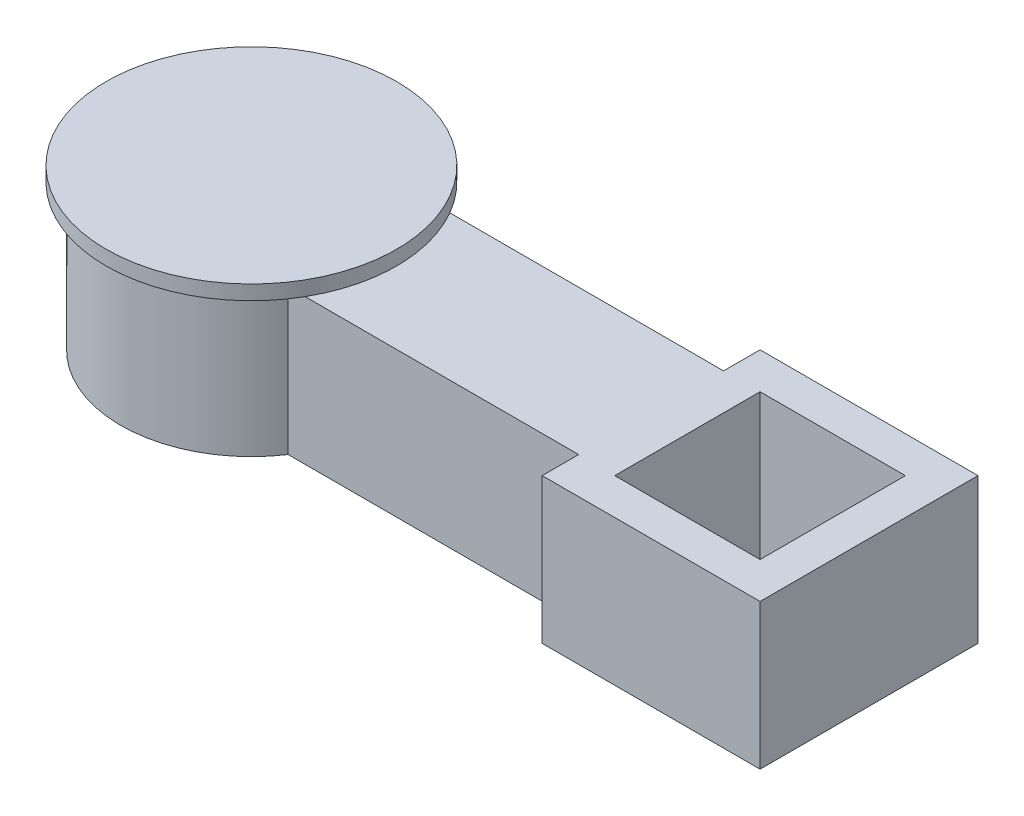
ISO-10303-21;
HEADER;
FILE_DESCRIPTION(('STEP AP214'),'2;1');
FILE_NAME('part.step','',(''),(''),'','','');
FILE_SCHEMA(('AUTOMOTIVE_DESIGN { 1 0 10303 214 1 1 1 1 }'));
ENDSEC;
DATA;
#1=APPLICATION_CONTEXT('core data for automotive mechanical design processes');
#2=APPLICATION_PROTOCOL_DEFINITION('international standard','automotive_design',2000,#1);
#3=PRODUCT_CONTEXT('',#1,'mechanical');
#4=PRODUCT('Part','Part','',(#3));
#5=PRODUCT_RELATED_PRODUCT_CATEGORY('part','',(#4));
#6=PRODUCT_DEFINITION_FORMATION('','',#4);
#7=PRODUCT_DEFINITION_CONTEXT('part definition',#1,'design');
#8=PRODUCT_DEFINITION('design','',#6,#7);
#9=PRODUCT_DEFINITION_SHAPE('','',#8);
#10=(LENGTH_UNIT() NAMED_UNIT(*) SI_UNIT(.MILLI.,.METRE.));
#11=(NAMED_UNIT(*) PLANE_ANGLE_UNIT() SI_UNIT($,.RADIAN.));
#12=(NAMED_UNIT(*) SI_UNIT($,.STERADIAN.) SOLID_ANGLE_UNIT());
#13=UNCERTAINTY_MEASURE_WITH_UNIT(LENGTH_MEASURE(1.E-05),#10,'distance_accuracy_value','');
#14=(GEOMETRIC_REPRESENTATION_CONTEXT(3) GLOBAL_UNCERTAINTY_ASSIGNED_CONTEXT((#13)) GLOBAL_UNIT_ASSIGNED_CONTEXT((#10,
#11,#12)) REPRESENTATION_CONTEXT('',''));
#15=CARTESIAN_POINT('',(0.,0.,0.));
#16=DIRECTION('',(0.,0.,1.));
#17=DIRECTION('',(1.,0.,0.));
#18=AXIS2_PLACEMENT_3D('',#15,#16,#17);
#19=CARTESIAN_POINT('',(363.145565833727,100.,8.04324209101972E-11));
#20=DIRECTION('',(-1.,0.,-2.21488098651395E-13));
#21=DIRECTION('',(-2.21488098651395E-13,0.,1.));
#22=AXIS2_PLACEMENT_3D('',#19,#20,#21);
#23=PLANE('',#22);
#24=DIRECTION('',(2.21488098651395E-13,0.,-1.));
#25=VECTOR('',#24,1.);
#26=CARTESIAN_POINT('',(363.145565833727,0.,8.04324209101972E-11));
#27=LINE('',#26,#25);
#28=CARTESIAN_POINT('',(363.145565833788,0.,-275.741810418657));
#29=VERTEX_POINT('',#28);
#30=CARTESIAN_POINT('',(363.145565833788,0.,-275.992438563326));
#31=VERTEX_POINT('',#30);
#32=EDGE_CURVE('E235',#29,#31,#27,.T.);
#33=ORIENTED_EDGE('',*,*,#32,.F.);
#34=DIRECTION('',(0.,-1.,0.));
#35=VECTOR('',#34,1.);
#36=CARTESIAN_POINT('',(363.145565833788,100.,-275.741810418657));
#37=LINE('',#36,#35);
#38=CARTESIAN_POINT('',(363.145565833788,100.,-275.741810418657));
#39=VERTEX_POINT('',#38);
#40=EDGE_CURVE('E12',#39,#29,#37,.T.);
#41=ORIENTED_EDGE('',*,*,#40,.F.);
#42=DIRECTION('',(2.21488098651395E-13,0.,-1.));
#43=VECTOR('',#42,1.);
#44=CARTESIAN_POINT('',(363.145565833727,100.,8.04324209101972E-11));
#45=LINE('',#44,#43);
#46=CARTESIAN_POINT('',(363.145565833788,100.,-275.992438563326));
#47=VERTEX_POINT('',#46);
#48=EDGE_CURVE('E220',#39,#47,#45,.T.);
#49=ORIENTED_EDGE('',*,*,#48,.T.);
#50=DIRECTION('',(0.,-1.,0.));
#51=VECTOR('',#50,1.);
#52=CARTESIAN_POINT('',(363.145565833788,100.,-275.992438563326));
#53=LINE('',#52,#51);
#54=EDGE_CURVE('E234',#47,#31,#53,.T.);
#55=ORIENTED_EDGE('',*,*,#54,.T.);
#56=EDGE_LOOP('',(#33,#41,#49,#55));
#57=FACE_BOUND('',#56,.T.);
#58=ADVANCED_FACE('F68',(#57),#23,.T.);
#59=CARTESIAN_POINT('',(288.145565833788,100.,-225.992438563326));
#60=DIRECTION('',(0.,-1.,0.));
#61=DIRECTION('',(0.,0.,-1.));
#62=AXIS2_PLACEMENT_3D('',#59,#60,#61);
#63=CYLINDRICAL_SURFACE('',#62,90.);
#64=CARTESIAN_POINT('',(288.145565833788,0.,-225.992438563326));
#65=DIRECTION('',(0.,1.,0.));
#66=DIRECTION('',(0.,0.,1.));
#67=AXIS2_PLACEMENT_3D('',#64,#65,#66);
#68=CIRCLE('',#67,90.);
#69=CARTESIAN_POINT('',(363.145565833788,0.,-176.243066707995));
#70=VERTEX_POINT('',#69);
#71=EDGE_CURVE('E238',#29,#70,#68,.T.);
#72=ORIENTED_EDGE('',*,*,#71,.T.);
#73=DIRECTION('',(0.,-1.,0.));
#74=VECTOR('',#73,1.);
#75=CARTESIAN_POINT('',(363.145565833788,100.,-176.243066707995));
#76=LINE('',#75,#74);
#77=CARTESIAN_POINT('',(363.145565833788,100.,-176.243066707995));
#78=VERTEX_POINT('',#77);
#79=EDGE_CURVE('E77',#78,#70,#76,.T.);
#80=ORIENTED_EDGE('',*,*,#79,.F.);
#81=CARTESIAN_POINT('',(288.145565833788,100.,-225.992438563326));
#82=DIRECTION('',(0.,1.,0.));
#83=DIRECTION('',(0.,0.,1.));
#84=AXIS2_PLACEMENT_3D('',#81,#82,#83);
#85=CIRCLE('',#84,90.);
#86=EDGE_CURVE('E223',#39,#78,#85,.T.);
#87=ORIENTED_EDGE('',*,*,#86,.F.);
#88=ORIENTED_EDGE('',*,*,#40,.T.);
#89=EDGE_LOOP('',(#72,#80,#87,#88));
#90=FACE_BOUND('',#89,.T.);
#91=ADVANCED_FACE('F316',(#90),#63,.T.);
#92=CARTESIAN_POINT('',(0.,100.,-176.243066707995));
#93=DIRECTION('',(0.,0.,-1.));
#94=DIRECTION('',(-1.,0.,0.));
#95=AXIS2_PLACEMENT_3D('',#92,#93,#94);
#96=PLANE('',#95);
#97=DIRECTION('',(1.,0.,0.));
#98=VECTOR('',#97,1.);
#99=CARTESIAN_POINT('',(0.,0.,-176.243066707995));
#100=LINE('',#99,#98);
#101=CARTESIAN_POINT('',(563.145565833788,0.,-176.243066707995));
#102=VERTEX_POINT('',#101);
#103=EDGE_CURVE('E240',#70,#102,#100,.T.);
#104=ORIENTED_EDGE('',*,*,#103,.T.);
#105=DIRECTION('',(0.,-1.,0.));
#106=VECTOR('',#105,1.);
#107=CARTESIAN_POINT('',(563.145565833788,100.,-176.243066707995));
#108=LINE('',#107,#106);
#109=CARTESIAN_POINT('',(563.145565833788,100.,-176.243066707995));
#110=VERTEX_POINT('',#109);
#111=EDGE_CURVE('E248',#110,#102,#108,.T.);
#112=ORIENTED_EDGE('',*,*,#111,.F.);
#113=DIRECTION('',(1.,0.,0.));
#114=VECTOR('',#113,1.);
#115=CARTESIAN_POINT('',(0.,100.,-176.243066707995));
#116=LINE('',#115,#114);
#117=CARTESIAN_POINT('',(374.892323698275,100.,-176.243066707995));
#118=VERTEX_POINT('',#117);
#119=EDGE_CURVE('E227',#118,#110,#116,.T.);
#120=ORIENTED_EDGE('',*,*,#119,.F.);
#121=EDGE_CURVE('E228',#78,#118,#116,.T.);
#122=ORIENTED_EDGE('',*,*,#121,.F.);
#123=ORIENTED_EDGE('',*,*,#79,.T.);
#124=EDGE_LOOP('',(#104,#112,#120,#122,#123));
#125=FACE_BOUND('',#124,.T.);
#126=ADVANCED_FACE('F312',(#125),#96,.F.);
#127=CARTESIAN_POINT('',(0.,100.,-275.992438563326));
#128=DIRECTION('',(0.,0.,-1.));
#129=DIRECTION('',(-1.,0.,0.));
#130=AXIS2_PLACEMENT_3D('',#127,#128,#129);
#131=PLANE('',#130);
#132=DIRECTION('',(1.,0.,0.));
#133=VECTOR('',#132,1.);
#134=CARTESIAN_POINT('',(0.,0.,-275.992438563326));
#135=LINE('',#134,#133);
#136=CARTESIAN_POINT('',(563.145565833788,0.,-275.992438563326));
#137=VERTEX_POINT('',#136);
#138=EDGE_CURVE('E224',#31,#137,#135,.T.);
#139=ORIENTED_EDGE('',*,*,#138,.F.);
#140=ORIENTED_EDGE('',*,*,#54,.F.);
#141=DIRECTION('',(1.,0.,0.));
#142=VECTOR('',#141,1.);
#143=CARTESIAN_POINT('',(0.,100.,-275.992438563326));
#144=LINE('',#143,#142);
#145=CARTESIAN_POINT('',(374.748106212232,100.,-275.992438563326));
#146=VERTEX_POINT('',#145);
#147=EDGE_CURVE('E232',#47,#146,#144,.T.);
#148=ORIENTED_EDGE('',*,*,#147,.T.);
#149=CARTESIAN_POINT('',(563.145565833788,100.,-275.992438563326));
#150=VERTEX_POINT('',#149);
#151=EDGE_CURVE('E231',#146,#150,#144,.T.);
#152=ORIENTED_EDGE('',*,*,#151,.T.);
#153=DIRECTION('',(0.,-1.,0.));
#154=VECTOR('',#153,1.);
#155=CARTESIAN_POINT('',(563.145565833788,100.,-275.992438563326));
#156=LINE('',#155,#154);
#157=EDGE_CURVE('E246',#150,#137,#156,.T.);
#158=ORIENTED_EDGE('',*,*,#157,.T.);
#159=EDGE_LOOP('',(#139,#140,#148,#152,#158));
#160=FACE_BOUND('',#159,.T.);
#161=ADVANCED_FACE('F323',(#160),#131,.T.);
#162=CARTESIAN_POINT('',(0.,100.,0.));
#163=DIRECTION('',(0.,1.,0.));
#164=DIRECTION('',(0.,0.,1.));
#165=AXIS2_PLACEMENT_3D('',#162,#163,#164);
#166=PLANE('',#165);
#167=DIRECTION('',(0.,0.,1.));
#168=VECTOR('',#167,1.);
#169=CARTESIAN_POINT('',(588.145565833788,100.,-176.117752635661));
#170=LINE('',#169,#168);
#171=CARTESIAN_POINT('',(588.145565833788,100.,-276.117752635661));
#172=VERTEX_POINT('',#171);
#173=CARTESIAN_POINT('',(588.145565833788,100.,-176.117752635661));
#174=VERTEX_POINT('',#173);
#175=EDGE_CURVE('E85',#172,#174,#170,.T.);
#176=ORIENTED_EDGE('',*,*,#175,.F.);
#177=DIRECTION('',(-1.,0.,0.));
#178=VECTOR('',#177,1.);
#179=CARTESIAN_POINT('',(588.145565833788,100.,-276.117752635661));
#180=LINE('',#179,#178);
#181=CARTESIAN_POINT('',(688.145565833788,100.,-276.117752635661));
#182=VERTEX_POINT('',#181);
#183=EDGE_CURVE('E188',#182,#172,#180,.T.);
#184=ORIENTED_EDGE('',*,*,#183,.F.);
#185=DIRECTION('',(0.,0.,-1.));
#186=VECTOR('',#185,1.);
#187=CARTESIAN_POINT('',(688.145565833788,100.,-176.117752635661));
#188=LINE('',#187,#186);
#189=CARTESIAN_POINT('',(688.145565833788,100.,-176.117752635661));
#190=VERTEX_POINT('',#189);
#191=EDGE_CURVE('E191',#190,#182,#188,.T.);
#192=ORIENTED_EDGE('',*,*,#191,.F.);
#193=DIRECTION('',(1.,0.,0.));
#194=VECTOR('',#193,1.);
#195=CARTESIAN_POINT('',(588.145565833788,100.,-176.117752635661));
#196=LINE('',#195,#194);
#197=EDGE_CURVE('E197',#174,#190,#196,.T.);
#198=ORIENTED_EDGE('',*,*,#197,.F.);
#199=EDGE_LOOP('',(#176,#184,#192,#198));
#200=FACE_BOUND('',#199,.T.);
#201=CARTESIAN_POINT('',(288.145565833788,100.,-225.992438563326));
#202=DIRECTION('',(0.,1.,0.));
#203=DIRECTION('',(0.,0.,1.));
#204=AXIS2_PLACEMENT_3D('',#201,#202,#203);
#205=CIRCLE('',#204,100.);
#206=EDGE_CURVE('E211',#118,#146,#205,.T.);
#207=ORIENTED_EDGE('',*,*,#206,.F.);
#208=ORIENTED_EDGE('',*,*,#119,.T.);
#209=DIRECTION('',(0.,0.,1.));
#210=VECTOR('',#209,1.);
#211=CARTESIAN_POINT('',(563.145565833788,100.,-301.117752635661));
#212=LINE('',#211,#210);
#213=CARTESIAN_POINT('',(563.145565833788,100.,-151.117752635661));
#214=VERTEX_POINT('',#213);
#215=EDGE_CURVE('E261',#110,#214,#212,.T.);
#216=ORIENTED_EDGE('',*,*,#215,.T.);
#217=DIRECTION('',(1.,0.,0.));
#218=VECTOR('',#217,1.);
#219=CARTESIAN_POINT('',(563.145565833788,100.,-151.117752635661));
#220=LINE('',#219,#218);
#221=CARTESIAN_POINT('',(713.145565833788,100.,-151.117752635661));
#222=VERTEX_POINT('',#221);
#223=EDGE_CURVE('E252',#214,#222,#220,.T.);
#224=ORIENTED_EDGE('',*,*,#223,.T.);
#225=DIRECTION('',(0.,0.,1.));
#226=VECTOR('',#225,1.);
#227=CARTESIAN_POINT('',(713.145565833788,100.,-301.117752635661));
#228=LINE('',#227,#226);
#229=CARTESIAN_POINT('',(713.145565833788,100.,-301.117752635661));
#230=VERTEX_POINT('',#229);
#231=EDGE_CURVE('E254',#230,#222,#228,.T.);
#232=ORIENTED_EDGE('',*,*,#231,.F.);
#233=DIRECTION('',(1.,0.,0.));
#234=VECTOR('',#233,1.);
#235=CARTESIAN_POINT('',(563.145565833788,100.,-301.117752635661));
#236=LINE('',#235,#234);
#237=CARTESIAN_POINT('',(563.145565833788,100.,-301.117752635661));
#238=VERTEX_POINT('',#237);
#239=EDGE_CURVE('E258',#238,#230,#236,.T.);
#240=ORIENTED_EDGE('',*,*,#239,.F.);
#241=EDGE_CURVE('E262',#238,#150,#212,.T.);
#242=ORIENTED_EDGE('',*,*,#241,.T.);
#243=ORIENTED_EDGE('',*,*,#151,.F.);
#244=EDGE_LOOP('',(#207,#208,#216,#224,#232,#240,#242,#243));
#245=FACE_BOUND('',#244,.T.);
#246=ADVANCED_FACE('F303',(#200,#245),#166,.T.);
#247=CARTESIAN_POINT('',(0.,0.,0.));
#248=DIRECTION('',(0.,1.,0.));
#249=DIRECTION('',(0.,0.,1.));
#250=AXIS2_PLACEMENT_3D('',#247,#248,#249);
#251=PLANE('',#250);
#252=DIRECTION('',(-1.,0.,0.));
#253=VECTOR('',#252,1.);
#254=CARTESIAN_POINT('',(588.145565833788,0.,-276.117752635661));
#255=LINE('',#254,#253);
#256=CARTESIAN_POINT('',(688.145565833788,0.,-276.117752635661));
#257=VERTEX_POINT('',#256);
#258=CARTESIAN_POINT('',(588.145565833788,0.,-276.117752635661));
#259=VERTEX_POINT('',#258);
#260=EDGE_CURVE('E178',#257,#259,#255,.T.);
#261=ORIENTED_EDGE('',*,*,#260,.T.);
#262=DIRECTION('',(0.,0.,1.));
#263=VECTOR('',#262,1.);
#264=CARTESIAN_POINT('',(588.145565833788,0.,-176.117752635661));
#265=LINE('',#264,#263);
#266=CARTESIAN_POINT('',(588.145565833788,0.,-176.117752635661));
#267=VERTEX_POINT('',#266);
#268=EDGE_CURVE('E172',#259,#267,#265,.T.);
#269=ORIENTED_EDGE('',*,*,#268,.T.);
#270=DIRECTION('',(1.,0.,0.));
#271=VECTOR('',#270,1.);
#272=CARTESIAN_POINT('',(588.145565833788,0.,-176.117752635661));
#273=LINE('',#272,#271);
#274=CARTESIAN_POINT('',(688.145565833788,0.,-176.117752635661));
#275=VERTEX_POINT('',#274);
#276=EDGE_CURVE('E181',#267,#275,#273,.T.);
#277=ORIENTED_EDGE('',*,*,#276,.T.);
#278=DIRECTION('',(0.,0.,-1.));
#279=VECTOR('',#278,1.);
#280=CARTESIAN_POINT('',(688.145565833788,0.,-176.117752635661));
#281=LINE('',#280,#279);
#282=EDGE_CURVE('E93',#275,#257,#281,.T.);
#283=ORIENTED_EDGE('',*,*,#282,.T.);
#284=EDGE_LOOP('',(#261,#269,#277,#283));
#285=FACE_BOUND('',#284,.T.);
#286=CARTESIAN_POINT('',(288.145565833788,0.,-225.992438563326));
#287=DIRECTION('',(0.,1.,0.));
#288=DIRECTION('',(0.,0.,1.));
#289=AXIS2_PLACEMENT_3D('',#286,#287,#288);
#290=CIRCLE('',#289,70.0000000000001);
#291=CARTESIAN_POINT('',(288.145565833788,0.,-155.992438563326));
#292=VERTEX_POINT('',#291);
#293=EDGE_CURVE('E214',#292,#292,#290,.T.);
#294=ORIENTED_EDGE('',*,*,#293,.T.);
#295=EDGE_LOOP('',(#294));
#296=FACE_BOUND('',#295,.T.);
#297=ORIENTED_EDGE('',*,*,#32,.T.);
#298=ORIENTED_EDGE('',*,*,#138,.T.);
#299=DIRECTION('',(0.,0.,1.));
#300=VECTOR('',#299,1.);
#301=CARTESIAN_POINT('',(563.145565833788,0.,-301.117752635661));
#302=LINE('',#301,#300);
#303=CARTESIAN_POINT('',(563.145565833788,0.,-301.117752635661));
#304=VERTEX_POINT('',#303);
#305=EDGE_CURVE('E255',#304,#137,#302,.T.);
#306=ORIENTED_EDGE('',*,*,#305,.F.);
#307=DIRECTION('',(1.,0.,0.));
#308=VECTOR('',#307,1.);
#309=CARTESIAN_POINT('',(563.145565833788,0.,-301.117752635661));
#310=LINE('',#309,#308);
#311=CARTESIAN_POINT('',(713.145565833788,0.,-301.117752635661));
#312=VERTEX_POINT('',#311);
#313=EDGE_CURVE('E271',#304,#312,#310,.T.);
#314=ORIENTED_EDGE('',*,*,#313,.T.);
#315=DIRECTION('',(0.,0.,1.));
#316=VECTOR('',#315,1.);
#317=CARTESIAN_POINT('',(713.145565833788,0.,-301.117752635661));
#318=LINE('',#317,#316);
#319=CARTESIAN_POINT('',(713.145565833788,0.,-151.117752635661));
#320=VERTEX_POINT('',#319);
#321=EDGE_CURVE('E268',#312,#320,#318,.T.);
#322=ORIENTED_EDGE('',*,*,#321,.T.);
#323=DIRECTION('',(1.,0.,0.));
#324=VECTOR('',#323,1.);
#325=CARTESIAN_POINT('',(563.145565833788,0.,-151.117752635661));
#326=LINE('',#325,#324);
#327=CARTESIAN_POINT('',(563.145565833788,0.,-151.117752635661));
#328=VERTEX_POINT('',#327);
#329=EDGE_CURVE('E217',#328,#320,#326,.T.);
#330=ORIENTED_EDGE('',*,*,#329,.F.);
#331=EDGE_CURVE('E274',#102,#328,#302,.T.);
#332=ORIENTED_EDGE('',*,*,#331,.F.);
#333=ORIENTED_EDGE('',*,*,#103,.F.);
#334=ORIENTED_EDGE('',*,*,#71,.F.);
#335=EDGE_LOOP('',(#297,#298,#306,#314,#322,#330,#332,#333,#334));
#336=FACE_BOUND('',#335,.T.);
#337=ADVANCED_FACE('F185',(#285,#296,#336),#251,.F.);
#338=CARTESIAN_POINT('',(713.145565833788,100.,-301.117752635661));
#339=DIRECTION('',(1.,0.,0.));
#340=DIRECTION('',(0.,0.,-1.));
#341=AXIS2_PLACEMENT_3D('',#338,#339,#340);
#342=PLANE('',#341);
#343=ORIENTED_EDGE('',*,*,#321,.F.);
#344=DIRECTION('',(0.,-1.,0.));
#345=VECTOR('',#344,1.);
#346=CARTESIAN_POINT('',(713.145565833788,100.,-301.117752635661));
#347=LINE('',#346,#345);
#348=EDGE_CURVE('E280',#230,#312,#347,.T.);
#349=ORIENTED_EDGE('',*,*,#348,.F.);
#350=ORIENTED_EDGE('',*,*,#231,.T.);
#351=DIRECTION('',(0.,-1.,0.));
#352=VECTOR('',#351,1.);
#353=CARTESIAN_POINT('',(713.145565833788,100.,-151.117752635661));
#354=LINE('',#353,#352);
#355=EDGE_CURVE('E72',#222,#320,#354,.T.);
#356=ORIENTED_EDGE('',*,*,#355,.T.);
#357=EDGE_LOOP('',(#343,#349,#350,#356));
#358=FACE_BOUND('',#357,.T.);
#359=ADVANCED_FACE('F286',(#358),#342,.T.);
#360=CARTESIAN_POINT('',(563.145565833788,100.,-301.117752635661));
#361=DIRECTION('',(0.,0.,-1.));
#362=DIRECTION('',(-1.,0.,0.));
#363=AXIS2_PLACEMENT_3D('',#360,#361,#362);
#364=PLANE('',#363);
#365=ORIENTED_EDGE('',*,*,#313,.F.);
#366=DIRECTION('',(0.,-1.,0.));
#367=VECTOR('',#366,1.);
#368=CARTESIAN_POINT('',(563.145565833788,100.,-301.117752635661));
#369=LINE('',#368,#367);
#370=EDGE_CURVE('E279',#238,#304,#369,.T.);
#371=ORIENTED_EDGE('',*,*,#370,.F.);
#372=ORIENTED_EDGE('',*,*,#239,.T.);
#373=ORIENTED_EDGE('',*,*,#348,.T.);
#374=EDGE_LOOP('',(#365,#371,#372,#373));
#375=FACE_BOUND('',#374,.T.);
#376=ADVANCED_FACE('F295',(#375),#364,.T.);
#377=CARTESIAN_POINT('',(563.145565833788,100.,-151.117752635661));
#378=DIRECTION('',(0.,0.,-1.));
#379=DIRECTION('',(-1.,0.,0.));
#380=AXIS2_PLACEMENT_3D('',#377,#378,#379);
#381=PLANE('',#380);
#382=ORIENTED_EDGE('',*,*,#329,.T.);
#383=ORIENTED_EDGE('',*,*,#355,.F.);
#384=ORIENTED_EDGE('',*,*,#223,.F.);
#385=DIRECTION('',(0.,-1.,0.));
#386=VECTOR('',#385,1.);
#387=CARTESIAN_POINT('',(563.145565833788,100.,-151.117752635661));
#388=LINE('',#387,#386);
#389=EDGE_CURVE('E265',#214,#328,#388,.T.);
#390=ORIENTED_EDGE('',*,*,#389,.T.);
#391=EDGE_LOOP('',(#382,#383,#384,#390));
#392=FACE_BOUND('',#391,.T.);
#393=ADVANCED_FACE('F70',(#392),#381,.F.);
#394=CARTESIAN_POINT('',(563.145565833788,100.,-301.117752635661));
#395=DIRECTION('',(1.,0.,0.));
#396=DIRECTION('',(0.,0.,-1.));
#397=AXIS2_PLACEMENT_3D('',#394,#395,#396);
#398=PLANE('',#397);
#399=ORIENTED_EDGE('',*,*,#215,.F.);
#400=ORIENTED_EDGE('',*,*,#111,.T.);
#401=ORIENTED_EDGE('',*,*,#331,.T.);
#402=ORIENTED_EDGE('',*,*,#389,.F.);
#403=EDGE_LOOP('',(#399,#400,#401,#402));
#404=FACE_BOUND('',#403,.T.);
#405=ADVANCED_FACE('F308',(#404),#398,.F.);
#406=ORIENTED_EDGE('',*,*,#157,.F.);
#407=ORIENTED_EDGE('',*,*,#241,.F.);
#408=ORIENTED_EDGE('',*,*,#370,.T.);
#409=ORIENTED_EDGE('',*,*,#305,.T.);
#410=EDGE_LOOP('',(#406,#407,#408,#409));
#411=FACE_BOUND('',#410,.T.);
#412=ADVANCED_FACE('F300',(#411),#398,.F.);
#413=CARTESIAN_POINT('',(288.145565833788,0.,-225.992438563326));
#414=DIRECTION('',(0.,1.,0.));
#415=DIRECTION('',(0.,0.,1.));
#416=AXIS2_PLACEMENT_3D('',#413,#414,#415);
#417=CYLINDRICAL_SURFACE('',#416,70.0000000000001);
#418=ORIENTED_EDGE('',*,*,#293,.F.);
#419=EDGE_LOOP('',(#418));
#420=FACE_BOUND('',#419,.T.);
#421=CARTESIAN_POINT('',(288.145565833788,100.,-225.992438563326));
#422=DIRECTION('',(0.,1.,0.));
#423=DIRECTION('',(0.,0.,1.));
#424=AXIS2_PLACEMENT_3D('',#421,#422,#423);
#425=CIRCLE('',#424,70.0000000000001);
#426=CARTESIAN_POINT('',(288.145565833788,100.,-155.992438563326));
#427=VERTEX_POINT('',#426);
#428=EDGE_CURVE('E210',#427,#427,#425,.T.);
#429=ORIENTED_EDGE('',*,*,#428,.T.);
#430=EDGE_LOOP('',(#429));
#431=FACE_BOUND('',#430,.T.);
#432=ADVANCED_FACE('F340',(#420,#431),#417,.F.);
#433=CARTESIAN_POINT('',(288.145565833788,110.,-225.992438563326));
#434=DIRECTION('',(0.,1.,0.));
#435=DIRECTION('',(0.,0.,1.));
#436=AXIS2_PLACEMENT_3D('',#433,#434,#435);
#437=PLANE('',#436);
#438=CARTESIAN_POINT('',(288.145565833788,110.,-225.992438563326));
#439=DIRECTION('',(0.,1.,0.));
#440=DIRECTION('',(0.,0.,1.));
#441=AXIS2_PLACEMENT_3D('',#438,#439,#440);
#442=CIRCLE('',#441,100.);
#443=CARTESIAN_POINT('',(288.145565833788,110.,-125.992438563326));
#444=VERTEX_POINT('',#443);
#445=EDGE_CURVE('E207',#444,#444,#442,.T.);
#446=ORIENTED_EDGE('',*,*,#445,.T.);
#447=EDGE_LOOP('',(#446));
#448=FACE_BOUND('',#447,.T.);
#449=ADVANCED_FACE('F331',(#448),#437,.T.);
#450=CARTESIAN_POINT('',(288.145565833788,110.,-225.992438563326));
#451=DIRECTION('',(0.,-1.,0.));
#452=DIRECTION('',(0.,0.,-1.));
#453=AXIS2_PLACEMENT_3D('',#450,#451,#452);
#454=CYLINDRICAL_SURFACE('',#453,100.);
#455=ORIENTED_EDGE('',*,*,#445,.F.);
#456=EDGE_LOOP('',(#455));
#457=FACE_BOUND('',#456,.T.);
#458=ORIENTED_EDGE('',*,*,#206,.T.);
#459=EDGE_CURVE('E203',#146,#118,#205,.T.);
#460=ORIENTED_EDGE('',*,*,#459,.T.);
#461=EDGE_LOOP('',(#458,#460));
#462=FACE_BOUND('',#461,.T.);
#463=ADVANCED_FACE('F329',(#457,#462),#454,.T.);
#464=CARTESIAN_POINT('',(288.145565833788,100.,-225.992438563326));
#465=DIRECTION('',(0.,1.,0.));
#466=DIRECTION('',(0.,0.,1.));
#467=AXIS2_PLACEMENT_3D('',#464,#465,#466);
#468=PLANE('',#467);
#469=ORIENTED_EDGE('',*,*,#86,.T.);
#470=ORIENTED_EDGE('',*,*,#121,.T.);
#471=ORIENTED_EDGE('',*,*,#459,.F.);
#472=ORIENTED_EDGE('',*,*,#147,.F.);
#473=ORIENTED_EDGE('',*,*,#48,.F.);
#474=EDGE_LOOP('',(#469,#470,#471,#472,#473));
#475=FACE_BOUND('',#474,.T.);
#476=ADVANCED_FACE('F327',(#475),#468,.F.);
#477=ORIENTED_EDGE('',*,*,#428,.F.);
#478=EDGE_LOOP('',(#477));
#479=FACE_BOUND('',#478,.T.);
#480=ADVANCED_FACE('F338',(#479),#468,.F.);
#481=CARTESIAN_POINT('',(588.145565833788,0.,-176.117752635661));
#482=DIRECTION('',(-1.,0.,0.));
#483=DIRECTION('',(0.,0.,1.));
#484=AXIS2_PLACEMENT_3D('',#481,#482,#483);
#485=PLANE('',#484);
#486=ORIENTED_EDGE('',*,*,#175,.T.);
#487=DIRECTION('',(0.,1.,0.));
#488=VECTOR('',#487,1.);
#489=CARTESIAN_POINT('',(588.145565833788,0.,-176.117752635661));
#490=LINE('',#489,#488);
#491=EDGE_CURVE('E168',#267,#174,#490,.T.);
#492=ORIENTED_EDGE('',*,*,#491,.F.);
#493=ORIENTED_EDGE('',*,*,#268,.F.);
#494=DIRECTION('',(0.,1.,0.));
#495=VECTOR('',#494,1.);
#496=CARTESIAN_POINT('',(588.145565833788,0.,-276.117752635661));
#497=LINE('',#496,#495);
#498=EDGE_CURVE('E201',#259,#172,#497,.T.);
#499=ORIENTED_EDGE('',*,*,#498,.T.);
#500=EDGE_LOOP('',(#486,#492,#493,#499));
#501=FACE_BOUND('',#500,.T.);
#502=ADVANCED_FACE('F170',(#501),#485,.F.);
#503=CARTESIAN_POINT('',(588.145565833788,0.,-276.117752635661));
#504=DIRECTION('',(0.,0.,-1.));
#505=DIRECTION('',(-1.,0.,0.));
#506=AXIS2_PLACEMENT_3D('',#503,#504,#505);
#507=PLANE('',#506);
#508=ORIENTED_EDGE('',*,*,#183,.T.);
#509=ORIENTED_EDGE('',*,*,#498,.F.);
#510=ORIENTED_EDGE('',*,*,#260,.F.);
#511=DIRECTION('',(0.,1.,0.));
#512=VECTOR('',#511,1.);
#513=CARTESIAN_POINT('',(688.145565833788,0.,-276.117752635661));
#514=LINE('',#513,#512);
#515=EDGE_CURVE('E204',#257,#182,#514,.T.);
#516=ORIENTED_EDGE('',*,*,#515,.T.);
#517=EDGE_LOOP('',(#508,#509,#510,#516));
#518=FACE_BOUND('',#517,.T.);
#519=ADVANCED_FACE('F379',(#518),#507,.F.);
#520=CARTESIAN_POINT('',(688.145565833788,0.,-176.117752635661));
#521=DIRECTION('',(1.,0.,0.));
#522=DIRECTION('',(0.,0.,-1.));
#523=AXIS2_PLACEMENT_3D('',#520,#521,#522);
#524=PLANE('',#523);
#525=ORIENTED_EDGE('',*,*,#191,.T.);
#526=ORIENTED_EDGE('',*,*,#515,.F.);
#527=ORIENTED_EDGE('',*,*,#282,.F.);
#528=DIRECTION('',(0.,1.,0.));
#529=VECTOR('',#528,1.);
#530=CARTESIAN_POINT('',(688.145565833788,0.,-176.117752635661));
#531=LINE('',#530,#529);
#532=EDGE_CURVE('E177',#275,#190,#531,.T.);
#533=ORIENTED_EDGE('',*,*,#532,.T.);
#534=EDGE_LOOP('',(#525,#526,#527,#533));
#535=FACE_BOUND('',#534,.T.);
#536=ADVANCED_FACE('F384',(#535),#524,.F.);
#537=CARTESIAN_POINT('',(588.145565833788,0.,-176.117752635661));
#538=DIRECTION('',(0.,0.,1.));
#539=DIRECTION('',(1.,0.,0.));
#540=AXIS2_PLACEMENT_3D('',#537,#538,#539);
#541=PLANE('',#540);
#542=ORIENTED_EDGE('',*,*,#197,.T.);
#543=ORIENTED_EDGE('',*,*,#532,.F.);
#544=ORIENTED_EDGE('',*,*,#276,.F.);
#545=ORIENTED_EDGE('',*,*,#491,.T.);
#546=EDGE_LOOP('',(#542,#543,#544,#545));
#547=FACE_BOUND('',#546,.T.);
#548=ADVANCED_FACE('F182',(#547),#541,.F.);
#549=CLOSED_SHELL('',(#58,#91,#126,#161,#246,#337,#359,#376,#393,#405,#412,#432,#449,#463,#476,
#480,#502,#519,#536,#548));
#550=MANIFOLD_SOLID_BREP('B2',#549);
#551=ADVANCED_BREP_SHAPE_REPRESENTATION('',(#18,#550),#14);
#552=SHAPE_DEFINITION_REPRESENTATION(#9,#551);
ENDSEC;
END-ISO-10303-21;
